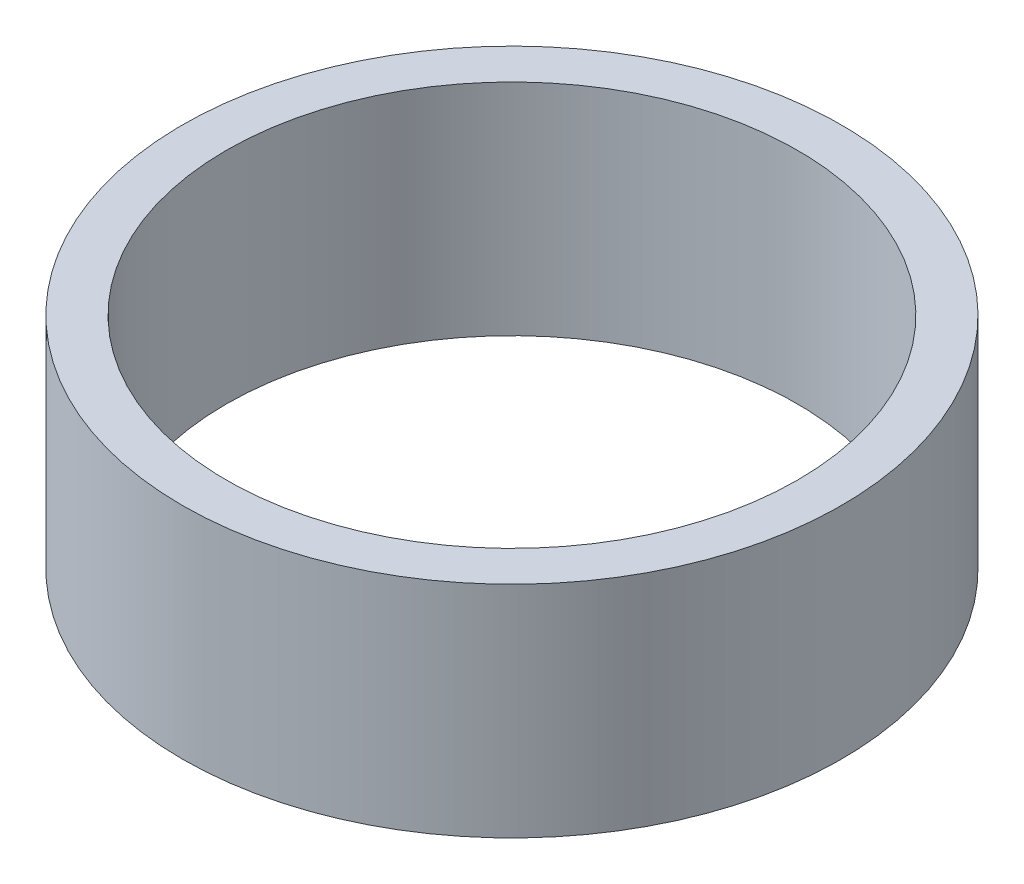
ISO-10303-21;
HEADER;
FILE_DESCRIPTION(('STEP AP214'),'2;1');
FILE_NAME('part.step','',(''),(''),'','','');
FILE_SCHEMA(('AUTOMOTIVE_DESIGN { 1 0 10303 214 1 1 1 1 }'));
ENDSEC;
DATA;
#1=APPLICATION_CONTEXT('core data for automotive mechanical design processes');
#2=APPLICATION_PROTOCOL_DEFINITION('international standard','automotive_design',2000,#1);
#3=PRODUCT_CONTEXT('',#1,'mechanical');
#4=PRODUCT('Part','Part','',(#3));
#5=PRODUCT_RELATED_PRODUCT_CATEGORY('part','',(#4));
#6=PRODUCT_DEFINITION_FORMATION('','',#4);
#7=PRODUCT_DEFINITION_CONTEXT('part definition',#1,'design');
#8=PRODUCT_DEFINITION('design','',#6,#7);
#9=PRODUCT_DEFINITION_SHAPE('','',#8);
#10=(LENGTH_UNIT() NAMED_UNIT(*) SI_UNIT(.MILLI.,.METRE.));
#11=(NAMED_UNIT(*) PLANE_ANGLE_UNIT() SI_UNIT($,.RADIAN.));
#12=(NAMED_UNIT(*) SI_UNIT($,.STERADIAN.) SOLID_ANGLE_UNIT());
#13=UNCERTAINTY_MEASURE_WITH_UNIT(LENGTH_MEASURE(1.E-05),#10,'distance_accuracy_value','');
#14=(GEOMETRIC_REPRESENTATION_CONTEXT(3) GLOBAL_UNCERTAINTY_ASSIGNED_CONTEXT((#13)) GLOBAL_UNIT_ASSIGNED_CONTEXT((#10,
#11,#12)) REPRESENTATION_CONTEXT('',''));
#15=CARTESIAN_POINT('',(0.,0.,0.));
#16=DIRECTION('',(0.,0.,1.));
#17=DIRECTION('',(1.,0.,0.));
#18=AXIS2_PLACEMENT_3D('',#15,#16,#17);
#19=CARTESIAN_POINT('',(0.,10.,0.));
#20=DIRECTION('',(0.,1.,0.));
#21=DIRECTION('',(0.,0.,1.));
#22=AXIS2_PLACEMENT_3D('',#19,#20,#21);
#23=PLANE('',#22);
#24=CARTESIAN_POINT('',(0.,10.,0.));
#25=DIRECTION('',(0.,1.,0.));
#26=DIRECTION('',(0.,0.,1.));
#27=AXIS2_PLACEMENT_3D('',#24,#25,#26);
#28=CIRCLE('',#27,15.);
#29=CARTESIAN_POINT('',(0.,10.,15.));
#30=VERTEX_POINT('',#29);
#31=EDGE_CURVE('E11',#30,#30,#28,.T.);
#32=ORIENTED_EDGE('',*,*,#31,.T.);
#33=EDGE_LOOP('',(#32));
#34=FACE_BOUND('',#33,.T.);
#35=CARTESIAN_POINT('',(0.,10.,0.));
#36=DIRECTION('',(0.,1.,0.));
#37=DIRECTION('',(1.,0.,0.));
#38=AXIS2_PLACEMENT_3D('',#35,#36,#37);
#39=CIRCLE('',#38,13.);
#40=CARTESIAN_POINT('',(13.,10.,0.));
#41=VERTEX_POINT('',#40);
#42=EDGE_CURVE('E48',#41,#41,#39,.T.);
#43=ORIENTED_EDGE('',*,*,#42,.F.);
#44=EDGE_LOOP('',(#43));
#45=FACE_BOUND('',#44,.T.);
#46=ADVANCED_FACE('F37',(#34,#45),#23,.T.);
#47=CARTESIAN_POINT('',(0.,0.,0.));
#48=DIRECTION('',(0.,1.,0.));
#49=DIRECTION('',(0.,0.,1.));
#50=AXIS2_PLACEMENT_3D('',#47,#48,#49);
#51=PLANE('',#50);
#52=CARTESIAN_POINT('',(0.,0.,0.));
#53=DIRECTION('',(0.,1.,0.));
#54=DIRECTION('',(0.,0.,1.));
#55=AXIS2_PLACEMENT_3D('',#52,#53,#54);
#56=CIRCLE('',#55,15.);
#57=CARTESIAN_POINT('',(0.,0.,15.));
#58=VERTEX_POINT('',#57);
#59=EDGE_CURVE('E41',#58,#58,#56,.T.);
#60=ORIENTED_EDGE('',*,*,#59,.F.);
#61=EDGE_LOOP('',(#60));
#62=FACE_BOUND('',#61,.T.);
#63=CARTESIAN_POINT('',(0.,0.,0.));
#64=DIRECTION('',(0.,1.,0.));
#65=DIRECTION('',(1.,0.,0.));
#66=AXIS2_PLACEMENT_3D('',#63,#64,#65);
#67=CIRCLE('',#66,13.);
#68=CARTESIAN_POINT('',(13.,0.,0.));
#69=VERTEX_POINT('',#68);
#70=EDGE_CURVE('E50',#69,#69,#67,.T.);
#71=ORIENTED_EDGE('',*,*,#70,.T.);
#72=EDGE_LOOP('',(#71));
#73=FACE_BOUND('',#72,.T.);
#74=ADVANCED_FACE('F60',(#62,#73),#51,.F.);
#75=CARTESIAN_POINT('',(0.,10.,0.));
#76=DIRECTION('',(0.,-1.,0.));
#77=DIRECTION('',(0.,0.,-1.));
#78=AXIS2_PLACEMENT_3D('',#75,#76,#77);
#79=CYLINDRICAL_SURFACE('',#78,15.);
#80=ORIENTED_EDGE('',*,*,#31,.F.);
#81=EDGE_LOOP('',(#80));
#82=FACE_BOUND('',#81,.T.);
#83=ORIENTED_EDGE('',*,*,#59,.T.);
#84=EDGE_LOOP('',(#83));
#85=FACE_BOUND('',#84,.T.);
#86=ADVANCED_FACE('F39',(#82,#85),#79,.T.);
#87=CARTESIAN_POINT('',(0.,10.,0.));
#88=DIRECTION('',(0.,-1.,0.));
#89=DIRECTION('',(0.,0.,-1.));
#90=AXIS2_PLACEMENT_3D('',#87,#88,#89);
#91=CYLINDRICAL_SURFACE('',#90,13.);
#92=ORIENTED_EDGE('',*,*,#42,.T.);
#93=EDGE_LOOP('',(#92));
#94=FACE_BOUND('',#93,.T.);
#95=ORIENTED_EDGE('',*,*,#70,.F.);
#96=EDGE_LOOP('',(#95));
#97=FACE_BOUND('',#96,.T.);
#98=ADVANCED_FACE('F56',(#94,#97),#91,.F.);
#99=CLOSED_SHELL('',(#46,#74,#86,#98));
#100=MANIFOLD_SOLID_BREP('B2',#99);
#101=ADVANCED_BREP_SHAPE_REPRESENTATION('',(#18,#100),#14);
#102=SHAPE_DEFINITION_REPRESENTATION(#9,#101);
ENDSEC;
END-ISO-10303-21;
